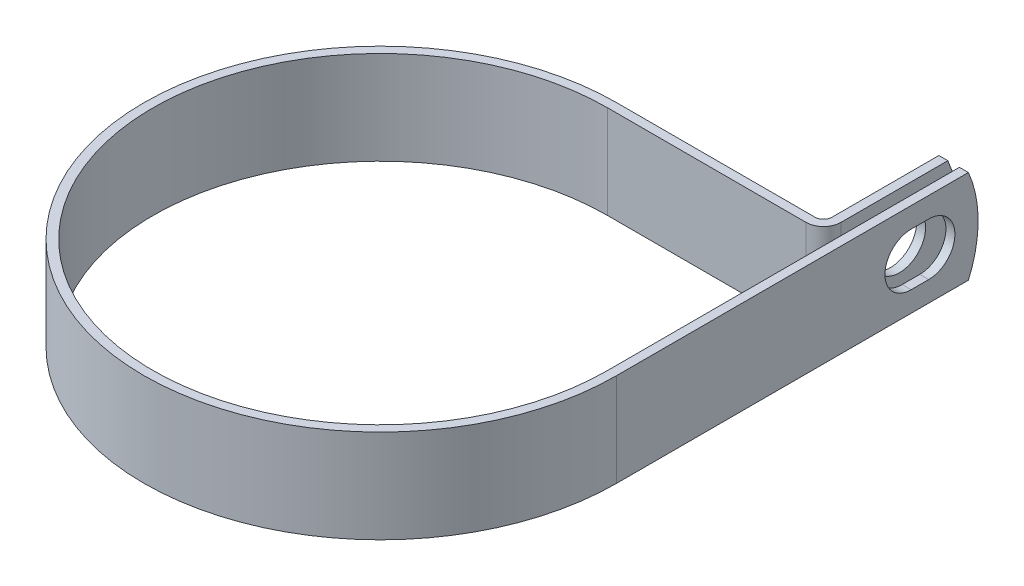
ISO-10303-21;
HEADER;
FILE_DESCRIPTION(('STEP AP214'),'2;1');
FILE_NAME('part.step','',(''),(''),'','','');
FILE_SCHEMA(('AUTOMOTIVE_DESIGN { 1 0 10303 214 1 1 1 1 }'));
ENDSEC;
DATA;
#1=APPLICATION_CONTEXT('core data for automotive mechanical design processes');
#2=APPLICATION_PROTOCOL_DEFINITION('international standard','automotive_design',2000,#1);
#3=PRODUCT_CONTEXT('',#1,'mechanical');
#4=PRODUCT('Part','Part','',(#3));
#5=PRODUCT_RELATED_PRODUCT_CATEGORY('part','',(#4));
#6=PRODUCT_DEFINITION_FORMATION('','',#4);
#7=PRODUCT_DEFINITION_CONTEXT('part definition',#1,'design');
#8=PRODUCT_DEFINITION('design','',#6,#7);
#9=PRODUCT_DEFINITION_SHAPE('','',#8);
#10=(LENGTH_UNIT() NAMED_UNIT(*) SI_UNIT(.MILLI.,.METRE.));
#11=(NAMED_UNIT(*) PLANE_ANGLE_UNIT() SI_UNIT($,.RADIAN.));
#12=(NAMED_UNIT(*) SI_UNIT($,.STERADIAN.) SOLID_ANGLE_UNIT());
#13=UNCERTAINTY_MEASURE_WITH_UNIT(LENGTH_MEASURE(1.E-05),#10,'distance_accuracy_value','');
#14=(GEOMETRIC_REPRESENTATION_CONTEXT(3) GLOBAL_UNCERTAINTY_ASSIGNED_CONTEXT((#13)) GLOBAL_UNIT_ASSIGNED_CONTEXT((#10,
#11,#12)) REPRESENTATION_CONTEXT('',''));
#15=CARTESIAN_POINT('',(0.,0.,0.));
#16=DIRECTION('',(0.,0.,1.));
#17=DIRECTION('',(1.,0.,0.));
#18=AXIS2_PLACEMENT_3D('',#15,#16,#17);
#19=CARTESIAN_POINT('',(30.9499,6.35,0.));
#20=DIRECTION('',(-1.,0.,0.));
#21=DIRECTION('',(0.,0.,1.));
#22=AXIS2_PLACEMENT_3D('',#19,#20,#21);
#23=PLANE('',#22);
#24=DIRECTION('',(0.,0.,-1.));
#25=VECTOR('',#24,1.);
#26=CARTESIAN_POINT('',(30.9499,-3.5687,-40.0811999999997));
#27=LINE('',#26,#25);
#28=CARTESIAN_POINT('',(30.9499,-3.5687,-40.0811999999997));
#29=VERTEX_POINT('',#28);
#30=CARTESIAN_POINT('',(30.9499,-3.5687,-42.4688000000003));
#31=VERTEX_POINT('',#30);
#32=EDGE_CURVE('E218',#29,#31,#27,.T.);
#33=ORIENTED_EDGE('',*,*,#32,.T.);
#34=CARTESIAN_POINT('',(30.9499,0.,-42.4687999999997));
#35=DIRECTION('',(-1.,0.,0.));
#36=DIRECTION('',(0.,0.,1.));
#37=AXIS2_PLACEMENT_3D('',#34,#35,#36);
#38=CIRCLE('',#37,3.5687);
#39=CARTESIAN_POINT('',(30.9499,3.5687,-42.4688000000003));
#40=VERTEX_POINT('',#39);
#41=EDGE_CURVE('E239',#31,#40,#38,.F.);
#42=ORIENTED_EDGE('',*,*,#41,.T.);
#43=DIRECTION('',(0.,0.,1.));
#44=VECTOR('',#43,1.);
#45=CARTESIAN_POINT('',(30.9499,3.5687,-40.0811999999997));
#46=LINE('',#45,#44);
#47=CARTESIAN_POINT('',(30.9499,3.5687,-40.0811999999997));
#48=VERTEX_POINT('',#47);
#49=EDGE_CURVE('E235',#40,#48,#46,.T.);
#50=ORIENTED_EDGE('',*,*,#49,.T.);
#51=CARTESIAN_POINT('',(30.9499,0.,-40.0811999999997));
#52=DIRECTION('',(-1.,0.,0.));
#53=DIRECTION('',(0.,0.,1.));
#54=AXIS2_PLACEMENT_3D('',#51,#52,#53);
#55=CIRCLE('',#54,3.5687);
#56=EDGE_CURVE('E230',#48,#29,#55,.F.);
#57=ORIENTED_EDGE('',*,*,#56,.T.);
#58=EDGE_LOOP('',(#33,#42,#50,#57));
#59=FACE_BOUND('',#58,.T.);
#60=CARTESIAN_POINT('',(30.9499,0.,-33.3248));
#61=DIRECTION('',(-1.,0.,0.));
#62=DIRECTION('',(0.,0.,1.));
#63=AXIS2_PLACEMENT_3D('',#60,#61,#62);
#64=CIRCLE('',#63,15.875);
#65=CARTESIAN_POINT('',(30.9499,6.35,-47.8744778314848));
#66=VERTEX_POINT('',#65);
#67=CARTESIAN_POINT('',(30.9499,-6.35,-47.8744778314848));
#68=VERTEX_POINT('',#67);
#69=EDGE_CURVE('E57',#66,#68,#64,.T.);
#70=ORIENTED_EDGE('',*,*,#69,.T.);
#71=DIRECTION('',(0.,0.,-1.));
#72=VECTOR('',#71,1.);
#73=CARTESIAN_POINT('',(30.9499,-6.35,0.));
#74=LINE('',#73,#72);
#75=CARTESIAN_POINT('',(30.9499,-6.35,0.));
#76=VERTEX_POINT('',#75);
#77=EDGE_CURVE('E253',#76,#68,#74,.T.);
#78=ORIENTED_EDGE('',*,*,#77,.F.);
#79=DIRECTION('',(0.,-1.,0.));
#80=VECTOR('',#79,1.);
#81=CARTESIAN_POINT('',(30.9499,6.35,0.));
#82=LINE('',#81,#80);
#83=CARTESIAN_POINT('',(30.9499,6.35,0.));
#84=VERTEX_POINT('',#83);
#85=EDGE_CURVE('E200',#84,#76,#82,.T.);
#86=ORIENTED_EDGE('',*,*,#85,.F.);
#87=DIRECTION('',(0.,0.,-1.));
#88=VECTOR('',#87,1.);
#89=CARTESIAN_POINT('',(30.9499,6.35,-30.9499));
#90=LINE('',#89,#88);
#91=EDGE_CURVE('E255',#84,#66,#90,.T.);
#92=ORIENTED_EDGE('',*,*,#91,.T.);
#93=EDGE_LOOP('',(#70,#78,#86,#92));
#94=FACE_BOUND('',#93,.T.);
#95=ADVANCED_FACE('F36',(#59,#94),#23,.T.);
#96=CARTESIAN_POINT('',(29.3751,6.35,-49.1998));
#97=DIRECTION('',(1.,0.,0.));
#98=DIRECTION('',(0.,0.,-1.));
#99=AXIS2_PLACEMENT_3D('',#96,#97,#98);
#100=PLANE('',#99);
#101=CARTESIAN_POINT('',(29.3751,0.,-41.275));
#102=DIRECTION('',(1.,0.,0.));
#103=DIRECTION('',(0.,0.,-1.));
#104=AXIS2_PLACEMENT_3D('',#101,#102,#103);
#105=CIRCLE('',#104,3.5687);
#106=CARTESIAN_POINT('',(29.3751,0.,-44.8437));
#107=VERTEX_POINT('',#106);
#108=EDGE_CURVE('E250',#107,#107,#105,.F.);
#109=ORIENTED_EDGE('',*,*,#108,.T.);
#110=EDGE_LOOP('',(#109));
#111=FACE_BOUND('',#110,.T.);
#112=DIRECTION('',(0.,0.,1.));
#113=VECTOR('',#112,1.);
#114=CARTESIAN_POINT('',(29.3751,-6.35,-49.1998));
#115=LINE('',#114,#113);
#116=CARTESIAN_POINT('',(29.3751,-6.35,-47.8744778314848));
#117=VERTEX_POINT('',#116);
#118=CARTESIAN_POINT('',(29.3751,-6.35,-33.32734));
#119=VERTEX_POINT('',#118);
#120=EDGE_CURVE('E166',#117,#119,#115,.T.);
#121=ORIENTED_EDGE('',*,*,#120,.F.);
#122=CARTESIAN_POINT('',(29.3751,0.,-33.3248));
#123=DIRECTION('',(1.,0.,0.));
#124=DIRECTION('',(0.,0.,-1.));
#125=AXIS2_PLACEMENT_3D('',#122,#123,#124);
#126=CIRCLE('',#125,15.875);
#127=CARTESIAN_POINT('',(29.3751,6.35,-47.8744778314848));
#128=VERTEX_POINT('',#127);
#129=EDGE_CURVE('E158',#117,#128,#126,.T.);
#130=ORIENTED_EDGE('',*,*,#129,.T.);
#131=DIRECTION('',(0.,0.,1.));
#132=VECTOR('',#131,1.);
#133=CARTESIAN_POINT('',(29.3751,6.35,-49.1998));
#134=LINE('',#133,#132);
#135=CARTESIAN_POINT('',(29.3751,6.35,-33.32734));
#136=VERTEX_POINT('',#135);
#137=EDGE_CURVE('E206',#128,#136,#134,.T.);
#138=ORIENTED_EDGE('',*,*,#137,.T.);
#139=DIRECTION('',(0.,-1.,0.));
#140=VECTOR('',#139,1.);
#141=CARTESIAN_POINT('',(29.3751,6.35,-33.32734));
#142=LINE('',#141,#140);
#143=EDGE_CURVE('E193',#136,#119,#142,.T.);
#144=ORIENTED_EDGE('',*,*,#143,.T.);
#145=EDGE_LOOP('',(#121,#130,#138,#144));
#146=FACE_BOUND('',#145,.T.);
#147=ADVANCED_FACE('F208',(#111,#146),#100,.T.);
#148=CARTESIAN_POINT('',(28.1559,6.35,-49.1998));
#149=DIRECTION('',(1.,0.,0.));
#150=DIRECTION('',(0.,0.,-1.));
#151=AXIS2_PLACEMENT_3D('',#148,#149,#150);
#152=PLANE('',#151);
#153=CARTESIAN_POINT('',(28.1559,0.,-41.275));
#154=DIRECTION('',(-1.,0.,0.));
#155=DIRECTION('',(0.,0.,1.));
#156=AXIS2_PLACEMENT_3D('',#153,#154,#155);
#157=CIRCLE('',#156,3.5687);
#158=CARTESIAN_POINT('',(28.1559,0.,-37.7063));
#159=VERTEX_POINT('',#158);
#160=EDGE_CURVE('E247',#159,#159,#157,.T.);
#161=ORIENTED_EDGE('',*,*,#160,.F.);
#162=EDGE_LOOP('',(#161));
#163=FACE_BOUND('',#162,.T.);
#164=CARTESIAN_POINT('',(28.1559,0.,-33.3248));
#165=DIRECTION('',(-1.,0.,0.));
#166=DIRECTION('',(0.,0.,1.));
#167=AXIS2_PLACEMENT_3D('',#164,#165,#166);
#168=CIRCLE('',#167,15.875);
#169=CARTESIAN_POINT('',(28.1559,6.35,-47.8744778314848));
#170=VERTEX_POINT('',#169);
#171=CARTESIAN_POINT('',(28.1559,-6.35,-47.8744778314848));
#172=VERTEX_POINT('',#171);
#173=EDGE_CURVE('E49',#170,#172,#168,.T.);
#174=ORIENTED_EDGE('',*,*,#173,.T.);
#175=DIRECTION('',(0.,0.,1.));
#176=VECTOR('',#175,1.);
#177=CARTESIAN_POINT('',(28.1559,-6.35,-49.1998));
#178=LINE('',#177,#176);
#179=CARTESIAN_POINT('',(28.1559,-6.35,-33.32734));
#180=VERTEX_POINT('',#179);
#181=EDGE_CURVE('E149',#172,#180,#178,.T.);
#182=ORIENTED_EDGE('',*,*,#181,.T.);
#183=DIRECTION('',(0.,-1.,0.));
#184=VECTOR('',#183,1.);
#185=CARTESIAN_POINT('',(28.1559,6.35,-33.32734));
#186=LINE('',#185,#184);
#187=CARTESIAN_POINT('',(28.1559,6.35,-33.32734));
#188=VERTEX_POINT('',#187);
#189=EDGE_CURVE('E191',#188,#180,#186,.T.);
#190=ORIENTED_EDGE('',*,*,#189,.F.);
#191=DIRECTION('',(0.,0.,1.));
#192=VECTOR('',#191,1.);
#193=CARTESIAN_POINT('',(28.1559,6.35,-49.1998));
#194=LINE('',#193,#192);
#195=EDGE_CURVE('E151',#170,#188,#194,.T.);
#196=ORIENTED_EDGE('',*,*,#195,.F.);
#197=EDGE_LOOP('',(#174,#182,#190,#196));
#198=FACE_BOUND('',#197,.T.);
#199=ADVANCED_FACE('F146',(#163,#198),#152,.F.);
#200=CARTESIAN_POINT('',(32.1691,6.35,0.));
#201=DIRECTION('',(-1.,0.,0.));
#202=DIRECTION('',(0.,0.,1.));
#203=AXIS2_PLACEMENT_3D('',#200,#201,#202);
#204=PLANE('',#203);
#205=CARTESIAN_POINT('',(32.1691,0.,-42.4687999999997));
#206=DIRECTION('',(1.,0.,0.));
#207=DIRECTION('',(0.,0.,-1.));
#208=AXIS2_PLACEMENT_3D('',#205,#206,#207);
#209=CIRCLE('',#208,3.5687);
#210=CARTESIAN_POINT('',(32.1691,-3.5687,-42.4688000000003));
#211=VERTEX_POINT('',#210);
#212=CARTESIAN_POINT('',(32.1691,3.5687,-42.4688000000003));
#213=VERTEX_POINT('',#212);
#214=EDGE_CURVE('E219',#211,#213,#209,.T.);
#215=ORIENTED_EDGE('',*,*,#214,.F.);
#216=DIRECTION('',(0.,0.,-1.));
#217=VECTOR('',#216,1.);
#218=CARTESIAN_POINT('',(32.1691,-3.5687,-40.0811999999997));
#219=LINE('',#218,#217);
#220=CARTESIAN_POINT('',(32.1691,-3.5687,-40.0811999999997));
#221=VERTEX_POINT('',#220);
#222=EDGE_CURVE('E222',#221,#211,#219,.T.);
#223=ORIENTED_EDGE('',*,*,#222,.F.);
#224=CARTESIAN_POINT('',(32.1691,0.,-40.0811999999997));
#225=DIRECTION('',(1.,0.,0.));
#226=DIRECTION('',(0.,0.,-1.));
#227=AXIS2_PLACEMENT_3D('',#224,#225,#226);
#228=CIRCLE('',#227,3.5687);
#229=CARTESIAN_POINT('',(32.1691,3.5687,-40.0811999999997));
#230=VERTEX_POINT('',#229);
#231=EDGE_CURVE('E212',#230,#221,#228,.T.);
#232=ORIENTED_EDGE('',*,*,#231,.F.);
#233=DIRECTION('',(0.,0.,1.));
#234=VECTOR('',#233,1.);
#235=CARTESIAN_POINT('',(32.1691,3.5687,-40.0811999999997));
#236=LINE('',#235,#234);
#237=EDGE_CURVE('E216',#213,#230,#236,.T.);
#238=ORIENTED_EDGE('',*,*,#237,.F.);
#239=EDGE_LOOP('',(#215,#223,#232,#238));
#240=FACE_BOUND('',#239,.T.);
#241=DIRECTION('',(0.,0.,-1.));
#242=VECTOR('',#241,1.);
#243=CARTESIAN_POINT('',(32.1691,-6.35,0.));
#244=LINE('',#243,#242);
#245=CARTESIAN_POINT('',(32.1691,-6.35,0.));
#246=VERTEX_POINT('',#245);
#247=CARTESIAN_POINT('',(32.1691,-6.35,-47.8744778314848));
#248=VERTEX_POINT('',#247);
#249=EDGE_CURVE('E177',#246,#248,#244,.T.);
#250=ORIENTED_EDGE('',*,*,#249,.T.);
#251=CARTESIAN_POINT('',(32.1691,0.,-33.3248));
#252=DIRECTION('',(-1.,0.,0.));
#253=DIRECTION('',(0.,0.,1.));
#254=AXIS2_PLACEMENT_3D('',#251,#252,#253);
#255=CIRCLE('',#254,15.875);
#256=CARTESIAN_POINT('',(32.1691,6.35,-47.8744778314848));
#257=VERTEX_POINT('',#256);
#258=EDGE_CURVE('E152',#257,#248,#255,.T.);
#259=ORIENTED_EDGE('',*,*,#258,.F.);
#260=DIRECTION('',(0.,0.,-1.));
#261=VECTOR('',#260,1.);
#262=CARTESIAN_POINT('',(32.1691,6.35,-30.9499));
#263=LINE('',#262,#261);
#264=CARTESIAN_POINT('',(32.1691,6.35,0.));
#265=VERTEX_POINT('',#264);
#266=EDGE_CURVE('E180',#265,#257,#263,.T.);
#267=ORIENTED_EDGE('',*,*,#266,.F.);
#268=DIRECTION('',(0.,-1.,0.));
#269=VECTOR('',#268,1.);
#270=CARTESIAN_POINT('',(32.1691,6.35,0.));
#271=LINE('',#270,#269);
#272=EDGE_CURVE('E181',#265,#246,#271,.T.);
#273=ORIENTED_EDGE('',*,*,#272,.T.);
#274=EDGE_LOOP('',(#250,#259,#267,#273));
#275=FACE_BOUND('',#274,.T.);
#276=ADVANCED_FACE('F303',(#240,#275),#204,.F.);
#277=CARTESIAN_POINT('',(0.,-6.35,0.));
#278=DIRECTION('',(0.,1.,0.));
#279=DIRECTION('',(1.,0.,0.));
#280=AXIS2_PLACEMENT_3D('',#277,#278,#279);
#281=PLANE('',#280);
#282=DIRECTION('',(-1.,0.,0.));
#283=VECTOR('',#282,1.);
#284=CARTESIAN_POINT('',(32.1691,-6.35,-47.8744778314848));
#285=LINE('',#284,#283);
#286=EDGE_CURVE('E153',#248,#68,#285,.T.);
#287=ORIENTED_EDGE('',*,*,#286,.F.);
#288=ORIENTED_EDGE('',*,*,#249,.F.);
#289=CARTESIAN_POINT('',(0.,-6.35,0.));
#290=DIRECTION('',(0.,1.,0.));
#291=DIRECTION('',(1.,0.,0.));
#292=AXIS2_PLACEMENT_3D('',#289,#290,#291);
#293=CIRCLE('',#292,32.1691);
#294=CARTESIAN_POINT('',(0.,-6.35,-32.1691));
#295=VERTEX_POINT('',#294);
#296=EDGE_CURVE('E175',#295,#246,#293,.T.);
#297=ORIENTED_EDGE('',*,*,#296,.F.);
#298=DIRECTION('',(1.,0.,0.));
#299=VECTOR('',#298,1.);
#300=CARTESIAN_POINT('',(0.,-6.35,-32.1691));
#301=LINE('',#300,#299);
#302=CARTESIAN_POINT('',(26.99766,-6.35,-32.1691));
#303=VERTEX_POINT('',#302);
#304=EDGE_CURVE('E168',#303,#295,#301,.F.);
#305=ORIENTED_EDGE('',*,*,#304,.F.);
#306=CARTESIAN_POINT('',(26.99766,-6.35,-33.32734));
#307=DIRECTION('',(0.,1.,0.));
#308=DIRECTION('',(1.,0.,0.));
#309=AXIS2_PLACEMENT_3D('',#306,#307,#308);
#310=CIRCLE('',#309,1.15824);
#311=EDGE_CURVE('E165',#180,#303,#310,.F.);
#312=ORIENTED_EDGE('',*,*,#311,.F.);
#313=ORIENTED_EDGE('',*,*,#181,.F.);
#314=DIRECTION('',(-1.,0.,0.));
#315=VECTOR('',#314,1.);
#316=CARTESIAN_POINT('',(32.1691,-6.35,-47.8744778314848));
#317=LINE('',#316,#315);
#318=EDGE_CURVE('E11',#117,#172,#317,.T.);
#319=ORIENTED_EDGE('',*,*,#318,.F.);
#320=ORIENTED_EDGE('',*,*,#120,.T.);
#321=CARTESIAN_POINT('',(26.99766,-6.35,-33.32734));
#322=DIRECTION('',(0.,-1.,0.));
#323=DIRECTION('',(0.,0.,1.));
#324=AXIS2_PLACEMENT_3D('',#321,#322,#323);
#325=CIRCLE('',#324,2.37744);
#326=CARTESIAN_POINT('',(26.99766,-6.35,-30.9499));
#327=VERTEX_POINT('',#326);
#328=EDGE_CURVE('E170',#119,#327,#325,.T.);
#329=ORIENTED_EDGE('',*,*,#328,.T.);
#330=DIRECTION('',(-1.,0.,0.));
#331=VECTOR('',#330,1.);
#332=CARTESIAN_POINT('',(0.,-6.35,-30.9499));
#333=LINE('',#332,#331);
#334=CARTESIAN_POINT('',(0.,-6.35,-30.9499));
#335=VERTEX_POINT('',#334);
#336=EDGE_CURVE('E280',#327,#335,#333,.T.);
#337=ORIENTED_EDGE('',*,*,#336,.T.);
#338=CARTESIAN_POINT('',(0.,-6.35,0.));
#339=DIRECTION('',(0.,1.,0.));
#340=DIRECTION('',(0.,0.,1.));
#341=AXIS2_PLACEMENT_3D('',#338,#339,#340);
#342=CIRCLE('',#341,30.9499);
#343=EDGE_CURVE('E277',#335,#76,#342,.T.);
#344=ORIENTED_EDGE('',*,*,#343,.T.);
#345=ORIENTED_EDGE('',*,*,#77,.T.);
#346=EDGE_LOOP('',(#287,#288,#297,#305,#312,#313,#319,#320,#329,#337,#344,#345));
#347=FACE_BOUND('',#346,.T.);
#348=ADVANCED_FACE('F163',(#347),#281,.F.);
#349=CARTESIAN_POINT('',(0.,6.35,0.));
#350=DIRECTION('',(0.,1.,0.));
#351=DIRECTION('',(1.,0.,0.));
#352=AXIS2_PLACEMENT_3D('',#349,#350,#351);
#353=PLANE('',#352);
#354=ORIENTED_EDGE('',*,*,#266,.T.);
#355=DIRECTION('',(-1.,0.,0.));
#356=VECTOR('',#355,1.);
#357=CARTESIAN_POINT('',(32.1691,6.35,-47.8744778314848));
#358=LINE('',#357,#356);
#359=EDGE_CURVE('E210',#257,#66,#358,.T.);
#360=ORIENTED_EDGE('',*,*,#359,.T.);
#361=ORIENTED_EDGE('',*,*,#91,.F.);
#362=CARTESIAN_POINT('',(0.,6.35,0.));
#363=DIRECTION('',(0.,1.,0.));
#364=DIRECTION('',(0.,0.,1.));
#365=AXIS2_PLACEMENT_3D('',#362,#363,#364);
#366=CIRCLE('',#365,30.9499);
#367=CARTESIAN_POINT('',(0.,6.35,-30.9499));
#368=VERTEX_POINT('',#367);
#369=EDGE_CURVE('E258',#368,#84,#366,.T.);
#370=ORIENTED_EDGE('',*,*,#369,.F.);
#371=DIRECTION('',(-1.,0.,0.));
#372=VECTOR('',#371,1.);
#373=CARTESIAN_POINT('',(0.,6.35,-30.9499));
#374=LINE('',#373,#372);
#375=CARTESIAN_POINT('',(26.99766,6.35,-30.9499));
#376=VERTEX_POINT('',#375);
#377=EDGE_CURVE('E261',#376,#368,#374,.T.);
#378=ORIENTED_EDGE('',*,*,#377,.F.);
#379=CARTESIAN_POINT('',(26.99766,6.35,-33.32734));
#380=DIRECTION('',(0.,-1.,0.));
#381=DIRECTION('',(0.,0.,1.));
#382=AXIS2_PLACEMENT_3D('',#379,#380,#381);
#383=CIRCLE('',#382,2.37744);
#384=EDGE_CURVE('E264',#136,#376,#383,.T.);
#385=ORIENTED_EDGE('',*,*,#384,.F.);
#386=ORIENTED_EDGE('',*,*,#137,.F.);
#387=DIRECTION('',(-1.,0.,0.));
#388=VECTOR('',#387,1.);
#389=CARTESIAN_POINT('',(32.1691,6.35,-47.8744778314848));
#390=LINE('',#389,#388);
#391=EDGE_CURVE('E43',#128,#170,#390,.T.);
#392=ORIENTED_EDGE('',*,*,#391,.T.);
#393=ORIENTED_EDGE('',*,*,#195,.T.);
#394=CARTESIAN_POINT('',(26.99766,6.35,-33.32734));
#395=DIRECTION('',(0.,1.,0.));
#396=DIRECTION('',(1.,0.,0.));
#397=AXIS2_PLACEMENT_3D('',#394,#395,#396);
#398=CIRCLE('',#397,1.15824);
#399=CARTESIAN_POINT('',(26.99766,6.35,-32.1691));
#400=VERTEX_POINT('',#399);
#401=EDGE_CURVE('E269',#188,#400,#398,.F.);
#402=ORIENTED_EDGE('',*,*,#401,.T.);
#403=DIRECTION('',(1.,0.,0.));
#404=VECTOR('',#403,1.);
#405=CARTESIAN_POINT('',(0.,6.35,-32.1691));
#406=LINE('',#405,#404);
#407=CARTESIAN_POINT('',(0.,6.35,-32.1691));
#408=VERTEX_POINT('',#407);
#409=EDGE_CURVE('E271',#400,#408,#406,.F.);
#410=ORIENTED_EDGE('',*,*,#409,.T.);
#411=CARTESIAN_POINT('',(0.,6.35,0.));
#412=DIRECTION('',(0.,1.,0.));
#413=DIRECTION('',(1.,0.,0.));
#414=AXIS2_PLACEMENT_3D('',#411,#412,#413);
#415=CIRCLE('',#414,32.1691);
#416=EDGE_CURVE('E185',#408,#265,#415,.T.);
#417=ORIENTED_EDGE('',*,*,#416,.T.);
#418=EDGE_LOOP('',(#354,#360,#361,#370,#378,#385,#386,#392,#393,#402,#410,#417));
#419=FACE_BOUND('',#418,.T.);
#420=ADVANCED_FACE('F204',(#419),#353,.T.);
#421=CARTESIAN_POINT('',(0.,6.35,0.));
#422=DIRECTION('',(0.,-1.,0.));
#423=DIRECTION('',(0.,0.,-1.));
#424=AXIS2_PLACEMENT_3D('',#421,#422,#423);
#425=CYLINDRICAL_SURFACE('',#424,30.9499);
#426=ORIENTED_EDGE('',*,*,#343,.F.);
#427=DIRECTION('',(0.,-1.,0.));
#428=VECTOR('',#427,1.);
#429=CARTESIAN_POINT('',(0.,6.35,-30.9499));
#430=LINE('',#429,#428);
#431=EDGE_CURVE('E198',#368,#335,#430,.T.);
#432=ORIENTED_EDGE('',*,*,#431,.F.);
#433=ORIENTED_EDGE('',*,*,#369,.T.);
#434=ORIENTED_EDGE('',*,*,#85,.T.);
#435=EDGE_LOOP('',(#426,#432,#433,#434));
#436=FACE_BOUND('',#435,.T.);
#437=ADVANCED_FACE('F293',(#436),#425,.F.);
#438=CARTESIAN_POINT('',(0.,6.35,-30.9499));
#439=DIRECTION('',(0.,0.,1.));
#440=DIRECTION('',(1.,0.,0.));
#441=AXIS2_PLACEMENT_3D('',#438,#439,#440);
#442=PLANE('',#441);
#443=ORIENTED_EDGE('',*,*,#336,.F.);
#444=DIRECTION('',(0.,-1.,0.));
#445=VECTOR('',#444,1.);
#446=CARTESIAN_POINT('',(26.99766,6.35,-30.9499));
#447=LINE('',#446,#445);
#448=EDGE_CURVE('E196',#376,#327,#447,.T.);
#449=ORIENTED_EDGE('',*,*,#448,.F.);
#450=ORIENTED_EDGE('',*,*,#377,.T.);
#451=ORIENTED_EDGE('',*,*,#431,.T.);
#452=EDGE_LOOP('',(#443,#449,#450,#451));
#453=FACE_BOUND('',#452,.T.);
#454=ADVANCED_FACE('F289',(#453),#442,.T.);
#455=CARTESIAN_POINT('',(26.99766,6.35,-33.32734));
#456=DIRECTION('',(0.,-1.,0.));
#457=DIRECTION('',(0.,0.,-1.));
#458=AXIS2_PLACEMENT_3D('',#455,#456,#457);
#459=CYLINDRICAL_SURFACE('',#458,2.37744);
#460=ORIENTED_EDGE('',*,*,#328,.F.);
#461=ORIENTED_EDGE('',*,*,#143,.F.);
#462=ORIENTED_EDGE('',*,*,#384,.T.);
#463=ORIENTED_EDGE('',*,*,#448,.T.);
#464=EDGE_LOOP('',(#460,#461,#462,#463));
#465=FACE_BOUND('',#464,.T.);
#466=ADVANCED_FACE('F286',(#465),#459,.T.);
#467=CARTESIAN_POINT('',(26.99766,6.35,-33.32734));
#468=DIRECTION('',(0.,-1.,0.));
#469=DIRECTION('',(0.,0.,-1.));
#470=AXIS2_PLACEMENT_3D('',#467,#468,#469);
#471=CYLINDRICAL_SURFACE('',#470,1.15824);
#472=ORIENTED_EDGE('',*,*,#311,.T.);
#473=DIRECTION('',(0.,-1.,0.));
#474=VECTOR('',#473,1.);
#475=CARTESIAN_POINT('',(26.99766,6.35,-32.1691));
#476=LINE('',#475,#474);
#477=EDGE_CURVE('E188',#400,#303,#476,.T.);
#478=ORIENTED_EDGE('',*,*,#477,.F.);
#479=ORIENTED_EDGE('',*,*,#401,.F.);
#480=ORIENTED_EDGE('',*,*,#189,.T.);
#481=EDGE_LOOP('',(#472,#478,#479,#480));
#482=FACE_BOUND('',#481,.T.);
#483=ADVANCED_FACE('F316',(#482),#471,.F.);
#484=CARTESIAN_POINT('',(0.,6.35,-32.1691));
#485=DIRECTION('',(0.,0.,1.));
#486=DIRECTION('',(1.,0.,0.));
#487=AXIS2_PLACEMENT_3D('',#484,#485,#486);
#488=PLANE('',#487);
#489=ORIENTED_EDGE('',*,*,#304,.T.);
#490=DIRECTION('',(0.,-1.,0.));
#491=VECTOR('',#490,1.);
#492=CARTESIAN_POINT('',(0.,6.35,-32.1691));
#493=LINE('',#492,#491);
#494=EDGE_CURVE('E184',#408,#295,#493,.T.);
#495=ORIENTED_EDGE('',*,*,#494,.F.);
#496=ORIENTED_EDGE('',*,*,#409,.F.);
#497=ORIENTED_EDGE('',*,*,#477,.T.);
#498=EDGE_LOOP('',(#489,#495,#496,#497));
#499=FACE_BOUND('',#498,.T.);
#500=ADVANCED_FACE('F312',(#499),#488,.F.);
#501=CARTESIAN_POINT('',(0.,6.35,0.));
#502=DIRECTION('',(0.,-1.,0.));
#503=DIRECTION('',(0.,0.,-1.));
#504=AXIS2_PLACEMENT_3D('',#501,#502,#503);
#505=CYLINDRICAL_SURFACE('',#504,32.1691);
#506=ORIENTED_EDGE('',*,*,#296,.T.);
#507=ORIENTED_EDGE('',*,*,#272,.F.);
#508=ORIENTED_EDGE('',*,*,#416,.F.);
#509=ORIENTED_EDGE('',*,*,#494,.T.);
#510=EDGE_LOOP('',(#506,#507,#508,#509));
#511=FACE_BOUND('',#510,.T.);
#512=ADVANCED_FACE('F309',(#511),#505,.T.);
#513=CARTESIAN_POINT('',(39.4689078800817,0.,-41.275));
#514=DIRECTION('',(-1.,0.,0.));
#515=DIRECTION('',(0.,0.,1.));
#516=AXIS2_PLACEMENT_3D('',#513,#514,#515);
#517=CYLINDRICAL_SURFACE('',#516,3.5687);
#518=ORIENTED_EDGE('',*,*,#160,.T.);
#519=EDGE_LOOP('',(#518));
#520=FACE_BOUND('',#519,.T.);
#521=ORIENTED_EDGE('',*,*,#108,.F.);
#522=EDGE_LOOP('',(#521));
#523=FACE_BOUND('',#522,.T.);
#524=ADVANCED_FACE('F361',(#520,#523),#517,.F.);
#525=CARTESIAN_POINT('',(19.0474589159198,-3.5687,-40.0811999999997));
#526=DIRECTION('',(0.,-1.,0.));
#527=DIRECTION('',(0.,0.,-1.));
#528=AXIS2_PLACEMENT_3D('',#525,#526,#527);
#529=PLANE('',#528);
#530=DIRECTION('',(1.,0.,0.));
#531=VECTOR('',#530,1.);
#532=CARTESIAN_POINT('',(19.0474589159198,-3.5687,-40.0811999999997));
#533=LINE('',#532,#531);
#534=EDGE_CURVE('E233',#29,#221,#533,.T.);
#535=ORIENTED_EDGE('',*,*,#534,.T.);
#536=ORIENTED_EDGE('',*,*,#222,.T.);
#537=DIRECTION('',(1.,0.,0.));
#538=VECTOR('',#537,1.);
#539=CARTESIAN_POINT('',(19.0474589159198,-3.5687,-42.4688000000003));
#540=LINE('',#539,#538);
#541=EDGE_CURVE('E229',#31,#211,#540,.T.);
#542=ORIENTED_EDGE('',*,*,#541,.F.);
#543=ORIENTED_EDGE('',*,*,#32,.F.);
#544=EDGE_LOOP('',(#535,#536,#542,#543));
#545=FACE_BOUND('',#544,.T.);
#546=ADVANCED_FACE('F336',(#545),#529,.F.);
#547=CARTESIAN_POINT('',(19.0474589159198,0.,-42.4687999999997));
#548=DIRECTION('',(1.,0.,0.));
#549=DIRECTION('',(0.,0.,-1.));
#550=AXIS2_PLACEMENT_3D('',#547,#548,#549);
#551=CYLINDRICAL_SURFACE('',#550,3.5687);
#552=ORIENTED_EDGE('',*,*,#541,.T.);
#553=ORIENTED_EDGE('',*,*,#214,.T.);
#554=DIRECTION('',(1.,0.,0.));
#555=VECTOR('',#554,1.);
#556=CARTESIAN_POINT('',(19.0474589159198,3.5687,-42.4688000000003));
#557=LINE('',#556,#555);
#558=EDGE_CURVE('E238',#40,#213,#557,.T.);
#559=ORIENTED_EDGE('',*,*,#558,.F.);
#560=ORIENTED_EDGE('',*,*,#41,.F.);
#561=EDGE_LOOP('',(#552,#553,#559,#560));
#562=FACE_BOUND('',#561,.T.);
#563=ADVANCED_FACE('F340',(#562),#551,.F.);
#564=CARTESIAN_POINT('',(19.0474589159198,3.5687,-40.0811999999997));
#565=DIRECTION('',(0.,1.,0.));
#566=DIRECTION('',(0.,0.,1.));
#567=AXIS2_PLACEMENT_3D('',#564,#565,#566);
#568=PLANE('',#567);
#569=ORIENTED_EDGE('',*,*,#558,.T.);
#570=ORIENTED_EDGE('',*,*,#237,.T.);
#571=DIRECTION('',(1.,0.,0.));
#572=VECTOR('',#571,1.);
#573=CARTESIAN_POINT('',(19.0474589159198,3.5687,-40.0811999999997));
#574=LINE('',#573,#572);
#575=EDGE_CURVE('E234',#48,#230,#574,.T.);
#576=ORIENTED_EDGE('',*,*,#575,.F.);
#577=ORIENTED_EDGE('',*,*,#49,.F.);
#578=EDGE_LOOP('',(#569,#570,#576,#577));
#579=FACE_BOUND('',#578,.T.);
#580=ADVANCED_FACE('F344',(#579),#568,.F.);
#581=CARTESIAN_POINT('',(19.0474589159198,0.,-40.0811999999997));
#582=DIRECTION('',(1.,0.,0.));
#583=DIRECTION('',(0.,0.,-1.));
#584=AXIS2_PLACEMENT_3D('',#581,#582,#583);
#585=CYLINDRICAL_SURFACE('',#584,3.5687);
#586=ORIENTED_EDGE('',*,*,#575,.T.);
#587=ORIENTED_EDGE('',*,*,#231,.T.);
#588=ORIENTED_EDGE('',*,*,#534,.F.);
#589=ORIENTED_EDGE('',*,*,#56,.F.);
#590=EDGE_LOOP('',(#586,#587,#588,#589));
#591=FACE_BOUND('',#590,.T.);
#592=ADVANCED_FACE('F348',(#591),#585,.F.);
#593=CARTESIAN_POINT('',(32.1691,0.,-33.3248));
#594=DIRECTION('',(-1.,0.,0.));
#595=DIRECTION('',(0.,0.,1.));
#596=AXIS2_PLACEMENT_3D('',#593,#594,#595);
#597=CYLINDRICAL_SURFACE('',#596,15.875);
#598=ORIENTED_EDGE('',*,*,#129,.F.);
#599=ORIENTED_EDGE('',*,*,#318,.T.);
#600=ORIENTED_EDGE('',*,*,#173,.F.);
#601=ORIENTED_EDGE('',*,*,#391,.F.);
#602=EDGE_LOOP('',(#598,#599,#600,#601));
#603=FACE_BOUND('',#602,.T.);
#604=ADVANCED_FACE('F156',(#603),#597,.T.);
#605=ORIENTED_EDGE('',*,*,#359,.F.);
#606=ORIENTED_EDGE('',*,*,#258,.T.);
#607=ORIENTED_EDGE('',*,*,#286,.T.);
#608=ORIENTED_EDGE('',*,*,#69,.F.);
#609=EDGE_LOOP('',(#605,#606,#607,#608));
#610=FACE_BOUND('',#609,.T.);
#611=ADVANCED_FACE('F298',(#610),#597,.T.);
#612=CLOSED_SHELL('',(#95,#147,#199,#276,#348,#420,#437,#454,#466,#483,#500,#512,#524,#546,#563,
#580,#592,#604,#611));
#613=MANIFOLD_SOLID_BREP('B2',#612);
#614=ADVANCED_BREP_SHAPE_REPRESENTATION('',(#18,#613),#14);
#615=SHAPE_DEFINITION_REPRESENTATION(#9,#614);
ENDSEC;
END-ISO-10303-21;
